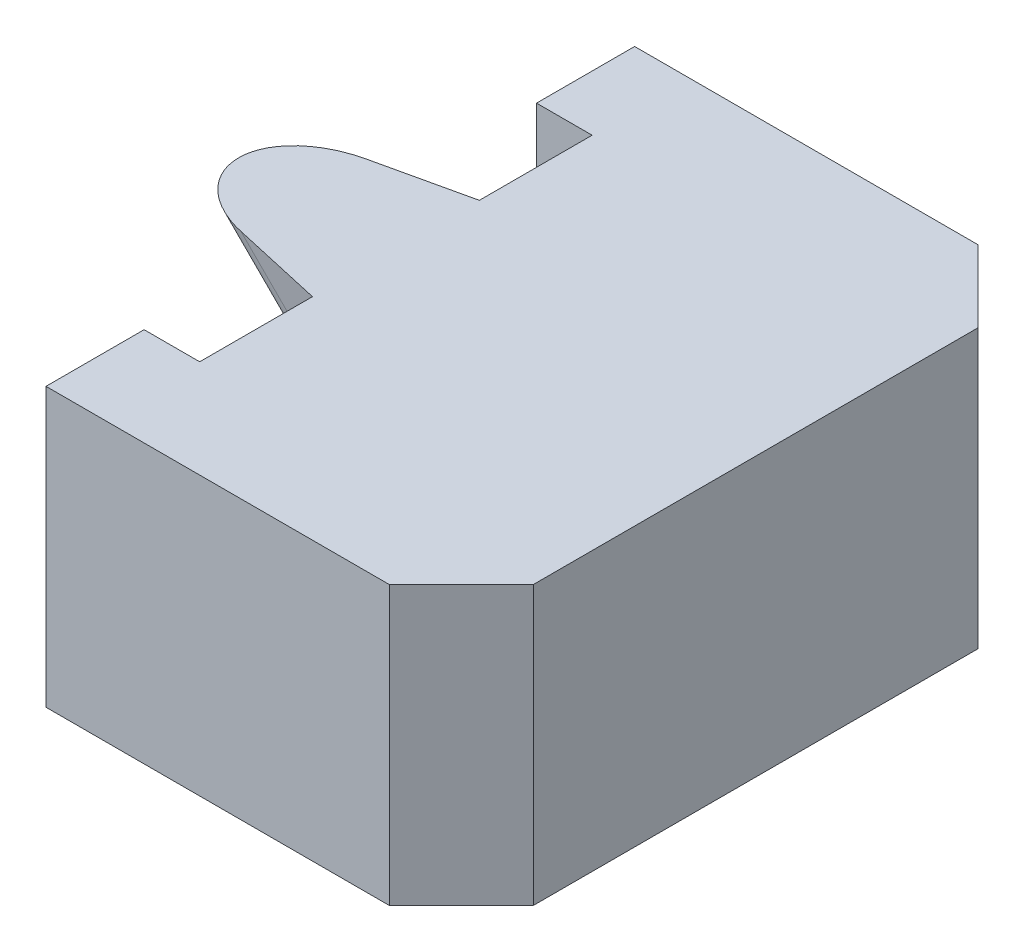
from build123d import *

# Parameters (mm, degrees)
SKIZZE1_W                       = 85.78807947
SKIZZE1_H                       = 57.19205298
LINEAR_AUSTRAGEN1_DEPTH         = 12.5
LINEAR_AUSTRAGEN2_DEPTH         = 8.5
VERRUNDUNG1_R                   = 3
LINEAR_AUSTRAGEN3_DEPTH         = 20
SKIZZE5_W                       = 85.78807947
SKIZZE5_H                       = 12.5
SCHNITT_LINEAR_AUSTRAGEN1_DEPTH = 57.19205298


with BuildPart() as part:
    # Skizze1 → Linear austragen1 (new body)
    with BuildSketch(Plane(origin=(0, 0, 0), x_dir=(1, 0, 0), z_dir=(0, 1, 0))):
        with Locations((-1.787251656, -4.766004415)):
            Rectangle(SKIZZE1_W, SKIZZE1_H)
    extrude(amount=LINEAR_AUSTRAGEN1_DEPTH)

    # Skizze2 → Linear austragen2 (add)
    with BuildSketch(Plane.XZ):
        Polygon((-26.360376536, 10.766004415), (-21.660376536, 10.766004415), (-21.660376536, -1.233995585), (-26.360376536, -1.233995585), (-26.360376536, -4.233995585), (-15.860376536, -4.233995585), (-13.660376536, -2.033995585), (-13.660376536, 11.566004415), (-15.860376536, 13.766004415), (-26.360376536, 13.766004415), align=None)
    extrude(amount=LINEAR_AUSTRAGEN2_DEPTH)

    # Verrundung1
    verrundung1_edges = [part.edges().sort_by_distance(p)[0] for p in [
        (-21.660376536, 0, 4.766004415),
    ]]
    fillet(verrundung1_edges, radius=VERRUNDUNG1_R)

    # Skizze4 → Linear austragen3 (add)
    with BuildSketch(Plane(origin=(-19.660376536, -6.5, 4.766004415), x_dir=(0, 0, 1), z_dir=(-0.7071067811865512, 0.707106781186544, 0))):
        with BuildLine():
            Line((-1.915413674, -0.937763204), (-3, 2.471572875))
            Line((-3, 2.471572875), (3, 2.471572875))
            Line((3, 2.471572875), (1.915413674, -0.937763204))
            ThreePointArc((1.915413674, -0.937763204), (0, -2.338427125), (-1.915413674, -0.937763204))
        make_face()
    extrude(amount=LINEAR_AUSTRAGEN3_DEPTH)

    # Skizze5 → Schnitt-Linear austragen1 (cut)
    with BuildSketch(Plane(origin=(0, 0, -23.830022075), x_dir=(-1, 0, 0), z_dir=(0, 0, -1))):
        with Locations((1.787251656, 6.25)):
            Rectangle(SKIZZE5_W, SKIZZE5_H)
    extrude(amount=-SCHNITT_LINEAR_AUSTRAGEN1_DEPTH, mode=Mode.SUBTRACT)


solid = part.part
